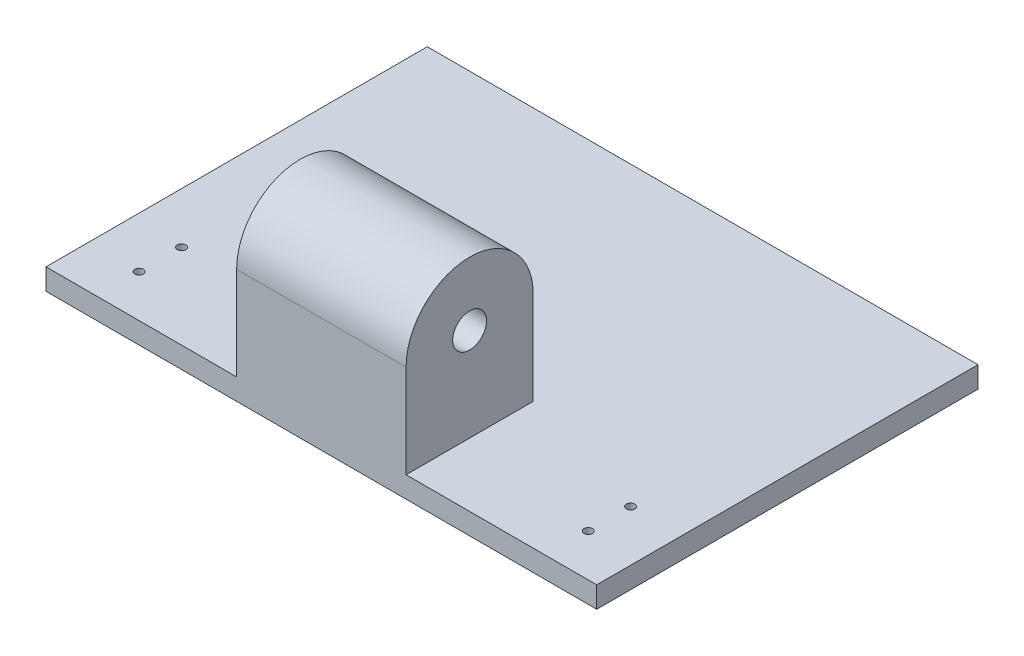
from build123d import *

# Parameters (mm, degrees)
EXTRUDE_1_DEPTH     = 40
SKETCH_3_W          = 130
SKETCH_3_H          = 30
EXTRUDE_2_DEPTH     = 5
CUT_EXTRUDE_2_REACH = 97.99
SKETCH_4_R          = 1
SKETCH_5_W          = 130
SKETCH_5_H          = 5
EXTRUDE_3_DEPTH     = 60


with BuildPart() as part:
    # Sketch 1 → Extrude 1 (new body)
    with BuildSketch(Plane(origin=(0, 0, 0), x_dir=(0, 0, -1), z_dir=(1, 0, 0))):
        with BuildLine():
            ThreePointArc((-4, 0), (0, 4), (4, 0))
            Line((4, 0), (15, 0))
            ThreePointArc((15, 0), (0, 15), (-15, 0))
            Line((-15, 0), (-4, 0))
        make_face()
        with BuildLine():
            Line((15, 0), (4, 0))
            ThreePointArc((4, 0), (0, -4), (-4, 0))
            Line((-4, 0), (-15, 0))
            ThreePointArc((-15, 0), (0, -15), (15, 0))
        make_face()
        with BuildLine():
            ThreePointArc((-4, 0), (0, 4), (4, 0))
            Line((4, 0), (15, 0))
            ThreePointArc((15, 0), (0, 15), (-15, 0))
            Line((-15, 0), (-4, 0))
        make_face()
        with BuildLine():
            Line((15, 0), (4, 0))
            ThreePointArc((4, 0), (0, -4), (-4, 0))
            Line((-4, 0), (-15, 0))
            ThreePointArc((-15, 0), (0, -15), (15, 0))
        make_face()
        with BuildLine():
            Line((15, -22), (15, 0))
            ThreePointArc((15, 0), (0, -15), (-15, 0))
            Line((-15, 0), (-15, -22))
            Line((-15, -22), (15, -22))
        make_face()
    extrude(amount=EXTRUDE_1_DEPTH)

    # Sketch 3 → Extrude 2 (add)
    with BuildSketch(Plane.XZ.offset(22)):
        with Locations((20, 0)):
            Rectangle(SKETCH_3_W, SKETCH_3_H)
    extrude(amount=EXTRUDE_2_DEPTH)

    # Sketch 4 → Cut-Extrude 2 (cut, up to next)
    with BuildSketch(Plane.XZ.offset(27), mode=Mode.PRIVATE) as cut_extrude_2_sk1:
        with Locations(Location((73, 5, 0), (0, 0, 270))):
            Circle(SKETCH_4_R)
    cut_extrude_2_tool1 = extrude(cut_extrude_2_sk1.sketch, amount=-CUT_EXTRUDE_2_REACH, mode=Mode.PRIVATE) & part.part
    # Sketch 4 → Cut-Extrude 2 (cut, up to next)
    with BuildSketch(Plane.XZ.offset(27), mode=Mode.PRIVATE) as cut_extrude_2_sk2:
        with Locations(Location((73, -5, 0), (0, 0, 270))):
            Circle(SKETCH_4_R)
    cut_extrude_2_tool2 = extrude(cut_extrude_2_sk2.sketch, amount=-CUT_EXTRUDE_2_REACH, mode=Mode.PRIVATE) & part.part
    # Sketch 4 → Cut-Extrude 2 (cut, up to next)
    with BuildSketch(Plane.XZ.offset(27), mode=Mode.PRIVATE) as cut_extrude_2_sk3:
        with Locations(Location((-33.02239123, 4.999974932, 0), (0, 0, 270))):
            Circle(SKETCH_4_R)
    cut_extrude_2_tool3 = extrude(cut_extrude_2_sk3.sketch, amount=-CUT_EXTRUDE_2_REACH, mode=Mode.PRIVATE) & part.part
    # Sketch 4 → Cut-Extrude 2 (cut, up to next)
    with BuildSketch(Plane.XZ.offset(27), mode=Mode.PRIVATE) as cut_extrude_2_sk4:
        with Locations(Location((-33, -5, 0), (0, 0, 270))):
            Circle(SKETCH_4_R)
    cut_extrude_2_tool4 = extrude(cut_extrude_2_sk4.sketch, amount=-CUT_EXTRUDE_2_REACH, mode=Mode.PRIVATE) & part.part
    add(cut_extrude_2_tool1.solids().sort_by_distance((73, -27, 5))[0], mode=Mode.SUBTRACT)
    add(cut_extrude_2_tool2.solids().sort_by_distance((73, -27, -5))[0], mode=Mode.SUBTRACT)
    add(cut_extrude_2_tool3.solids().sort_by_distance((-33.022391, -27, 4.999975))[0], mode=Mode.SUBTRACT)
    add(cut_extrude_2_tool4.solids().sort_by_distance((-33, -27, -5))[0], mode=Mode.SUBTRACT)

    # Sketch 5 → Extrude 3 (add)
    with BuildSketch(Plane(origin=(0, 0, -15), x_dir=(-1, 0, 0), z_dir=(0, 0, -1))):
        with Locations((-20, -24.5)):
            Rectangle(SKETCH_5_W, SKETCH_5_H)
    extrude(amount=EXTRUDE_3_DEPTH)


solid = part.part
